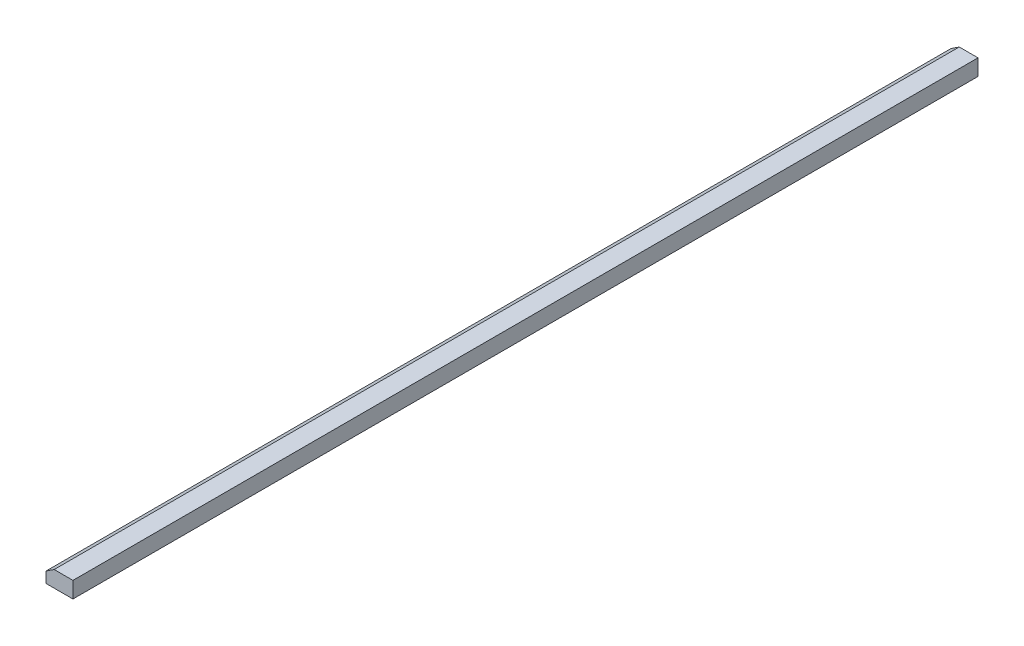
from build123d import *

# Parameters (mm, degrees)
EXTRUSION1_DEPTH = 840


with BuildPart() as part:
    # Esquisse1 → Extrusion1 (new body)
    with BuildSketch(Plane.XY):
        Polygon((0, 3.421879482), (25, 3.421879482), (25, 18.421879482), (7.565231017, 18.421879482), (0, 13.417188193), align=None)
    extrude(amount=EXTRUSION1_DEPTH)


solid = part.part
